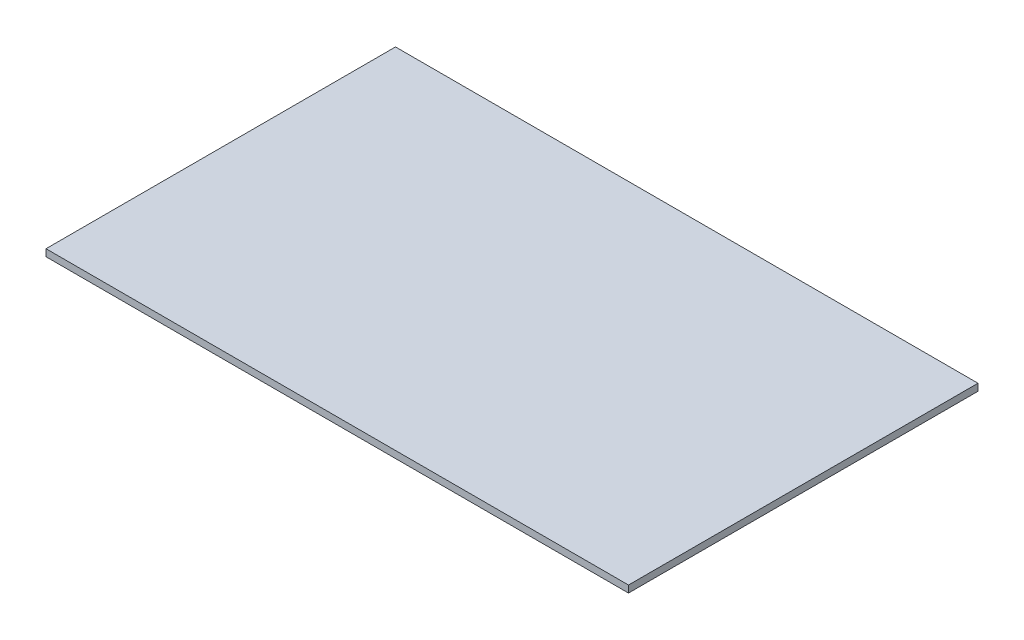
ISO-10303-21;
HEADER;
FILE_DESCRIPTION(('STEP AP214'),'2;1');
FILE_NAME('part.step','',(''),(''),'','','');
FILE_SCHEMA(('AUTOMOTIVE_DESIGN { 1 0 10303 214 1 1 1 1 }'));
ENDSEC;
DATA;
#1=APPLICATION_CONTEXT('core data for automotive mechanical design processes');
#2=APPLICATION_PROTOCOL_DEFINITION('international standard','automotive_design',2000,#1);
#3=PRODUCT_CONTEXT('',#1,'mechanical');
#4=PRODUCT('Part','Part','',(#3));
#5=PRODUCT_RELATED_PRODUCT_CATEGORY('part','',(#4));
#6=PRODUCT_DEFINITION_FORMATION('','',#4);
#7=PRODUCT_DEFINITION_CONTEXT('part definition',#1,'design');
#8=PRODUCT_DEFINITION('design','',#6,#7);
#9=PRODUCT_DEFINITION_SHAPE('','',#8);
#10=(LENGTH_UNIT() NAMED_UNIT(*) SI_UNIT(.MILLI.,.METRE.));
#11=(NAMED_UNIT(*) PLANE_ANGLE_UNIT() SI_UNIT($,.RADIAN.));
#12=(NAMED_UNIT(*) SI_UNIT($,.STERADIAN.) SOLID_ANGLE_UNIT());
#13=UNCERTAINTY_MEASURE_WITH_UNIT(LENGTH_MEASURE(1.E-05),#10,'distance_accuracy_value','');
#14=(GEOMETRIC_REPRESENTATION_CONTEXT(3) GLOBAL_UNCERTAINTY_ASSIGNED_CONTEXT((#13)) GLOBAL_UNIT_ASSIGNED_CONTEXT((#10,
#11,#12)) REPRESENTATION_CONTEXT('',''));
#15=CARTESIAN_POINT('',(0.,0.,0.));
#16=DIRECTION('',(0.,0.,1.));
#17=DIRECTION('',(1.,0.,0.));
#18=AXIS2_PLACEMENT_3D('',#15,#16,#17);
#19=CARTESIAN_POINT('',(762.,18.25625,-457.2));
#20=DIRECTION('',(-1.,0.,0.));
#21=DIRECTION('',(0.,0.,1.));
#22=AXIS2_PLACEMENT_3D('',#19,#20,#21);
#23=PLANE('',#22);
#24=DIRECTION('',(0.,0.,-1.));
#25=VECTOR('',#24,1.);
#26=CARTESIAN_POINT('',(762.,0.,-457.2));
#27=LINE('',#26,#25);
#28=CARTESIAN_POINT('',(762.,0.,457.2));
#29=VERTEX_POINT('',#28);
#30=CARTESIAN_POINT('',(762.,0.,-457.2));
#31=VERTEX_POINT('',#30);
#32=EDGE_CURVE('E95',#29,#31,#27,.T.);
#33=ORIENTED_EDGE('',*,*,#32,.T.);
#34=DIRECTION('',(0.,-1.,0.));
#35=VECTOR('',#34,1.);
#36=CARTESIAN_POINT('',(762.,18.25625,-457.2));
#37=LINE('',#36,#35);
#38=CARTESIAN_POINT('',(762.,18.25625,-457.2));
#39=VERTEX_POINT('',#38);
#40=EDGE_CURVE('E11',#39,#31,#37,.T.);
#41=ORIENTED_EDGE('',*,*,#40,.F.);
#42=DIRECTION('',(0.,0.,-1.));
#43=VECTOR('',#42,1.);
#44=CARTESIAN_POINT('',(762.,18.25625,-457.2));
#45=LINE('',#44,#43);
#46=CARTESIAN_POINT('',(762.,18.25625,457.2));
#47=VERTEX_POINT('',#46);
#48=EDGE_CURVE('E83',#47,#39,#45,.T.);
#49=ORIENTED_EDGE('',*,*,#48,.F.);
#50=DIRECTION('',(0.,-1.,0.));
#51=VECTOR('',#50,1.);
#52=CARTESIAN_POINT('',(762.,18.25625,457.2));
#53=LINE('',#52,#51);
#54=EDGE_CURVE('E91',#47,#29,#53,.T.);
#55=ORIENTED_EDGE('',*,*,#54,.T.);
#56=EDGE_LOOP('',(#33,#41,#49,#55));
#57=FACE_BOUND('',#56,.T.);
#58=ADVANCED_FACE('F32',(#57),#23,.F.);
#59=CARTESIAN_POINT('',(-762.,18.25625,-457.2));
#60=DIRECTION('',(0.,0.,1.));
#61=DIRECTION('',(1.,0.,0.));
#62=AXIS2_PLACEMENT_3D('',#59,#60,#61);
#63=PLANE('',#62);
#64=DIRECTION('',(-1.,0.,0.));
#65=VECTOR('',#64,1.);
#66=CARTESIAN_POINT('',(-762.,0.,-457.2));
#67=LINE('',#66,#65);
#68=CARTESIAN_POINT('',(-762.,0.,-457.2));
#69=VERTEX_POINT('',#68);
#70=EDGE_CURVE('E87',#31,#69,#67,.T.);
#71=ORIENTED_EDGE('',*,*,#70,.T.);
#72=DIRECTION('',(0.,-1.,0.));
#73=VECTOR('',#72,1.);
#74=CARTESIAN_POINT('',(-762.,18.25625,-457.2));
#75=LINE('',#74,#73);
#76=CARTESIAN_POINT('',(-762.,18.25625,-457.2));
#77=VERTEX_POINT('',#76);
#78=EDGE_CURVE('E40',#77,#69,#75,.T.);
#79=ORIENTED_EDGE('',*,*,#78,.F.);
#80=DIRECTION('',(-1.,0.,0.));
#81=VECTOR('',#80,1.);
#82=CARTESIAN_POINT('',(-762.,18.25625,-457.2));
#83=LINE('',#82,#81);
#84=EDGE_CURVE('E78',#39,#77,#83,.T.);
#85=ORIENTED_EDGE('',*,*,#84,.F.);
#86=ORIENTED_EDGE('',*,*,#40,.T.);
#87=EDGE_LOOP('',(#71,#79,#85,#86));
#88=FACE_BOUND('',#87,.T.);
#89=ADVANCED_FACE('F86',(#88),#63,.F.);
#90=CARTESIAN_POINT('',(-762.,18.25625,-457.2));
#91=DIRECTION('',(1.,0.,0.));
#92=DIRECTION('',(0.,0.,-1.));
#93=AXIS2_PLACEMENT_3D('',#90,#91,#92);
#94=PLANE('',#93);
#95=DIRECTION('',(0.,0.,1.));
#96=VECTOR('',#95,1.);
#97=CARTESIAN_POINT('',(-762.,0.,-457.2));
#98=LINE('',#97,#96);
#99=CARTESIAN_POINT('',(-762.,0.,457.2));
#100=VERTEX_POINT('',#99);
#101=EDGE_CURVE('E65',#69,#100,#98,.T.);
#102=ORIENTED_EDGE('',*,*,#101,.T.);
#103=DIRECTION('',(0.,-1.,0.));
#104=VECTOR('',#103,1.);
#105=CARTESIAN_POINT('',(-762.,18.25625,457.2));
#106=LINE('',#105,#104);
#107=CARTESIAN_POINT('',(-762.,18.25625,457.2));
#108=VERTEX_POINT('',#107);
#109=EDGE_CURVE('E88',#108,#100,#106,.T.);
#110=ORIENTED_EDGE('',*,*,#109,.F.);
#111=DIRECTION('',(0.,0.,1.));
#112=VECTOR('',#111,1.);
#113=CARTESIAN_POINT('',(-762.,18.25625,-457.2));
#114=LINE('',#113,#112);
#115=EDGE_CURVE('E81',#77,#108,#114,.T.);
#116=ORIENTED_EDGE('',*,*,#115,.F.);
#117=ORIENTED_EDGE('',*,*,#78,.T.);
#118=EDGE_LOOP('',(#102,#110,#116,#117));
#119=FACE_BOUND('',#118,.T.);
#120=ADVANCED_FACE('F89',(#119),#94,.F.);
#121=CARTESIAN_POINT('',(-762.,18.25625,457.2));
#122=DIRECTION('',(0.,0.,-1.));
#123=DIRECTION('',(-1.,0.,0.));
#124=AXIS2_PLACEMENT_3D('',#121,#122,#123);
#125=PLANE('',#124);
#126=DIRECTION('',(1.,0.,0.));
#127=VECTOR('',#126,1.);
#128=CARTESIAN_POINT('',(-762.,0.,457.2));
#129=LINE('',#128,#127);
#130=EDGE_CURVE('E71',#100,#29,#129,.T.);
#131=ORIENTED_EDGE('',*,*,#130,.T.);
#132=ORIENTED_EDGE('',*,*,#54,.F.);
#133=DIRECTION('',(1.,0.,0.));
#134=VECTOR('',#133,1.);
#135=CARTESIAN_POINT('',(-762.,18.25625,457.2));
#136=LINE('',#135,#134);
#137=EDGE_CURVE('E48',#108,#47,#136,.T.);
#138=ORIENTED_EDGE('',*,*,#137,.F.);
#139=ORIENTED_EDGE('',*,*,#109,.T.);
#140=EDGE_LOOP('',(#131,#132,#138,#139));
#141=FACE_BOUND('',#140,.T.);
#142=ADVANCED_FACE('F102',(#141),#125,.F.);
#143=CARTESIAN_POINT('',(0.,18.25625,0.));
#144=DIRECTION('',(0.,1.,0.));
#145=DIRECTION('',(0.,0.,1.));
#146=AXIS2_PLACEMENT_3D('',#143,#144,#145);
#147=PLANE('',#146);
#148=ORIENTED_EDGE('',*,*,#48,.T.);
#149=ORIENTED_EDGE('',*,*,#84,.T.);
#150=ORIENTED_EDGE('',*,*,#115,.T.);
#151=ORIENTED_EDGE('',*,*,#137,.T.);
#152=EDGE_LOOP('',(#148,#149,#150,#151));
#153=FACE_BOUND('',#152,.T.);
#154=ADVANCED_FACE('F79',(#153),#147,.T.);
#155=CARTESIAN_POINT('',(0.,0.,0.));
#156=DIRECTION('',(0.,1.,0.));
#157=DIRECTION('',(0.,0.,1.));
#158=AXIS2_PLACEMENT_3D('',#155,#156,#157);
#159=PLANE('',#158);
#160=ORIENTED_EDGE('',*,*,#32,.F.);
#161=ORIENTED_EDGE('',*,*,#130,.F.);
#162=ORIENTED_EDGE('',*,*,#101,.F.);
#163=ORIENTED_EDGE('',*,*,#70,.F.);
#164=EDGE_LOOP('',(#160,#161,#162,#163));
#165=FACE_BOUND('',#164,.T.);
#166=ADVANCED_FACE('F105',(#165),#159,.F.);
#167=CLOSED_SHELL('',(#58,#89,#120,#142,#154,#166));
#168=MANIFOLD_SOLID_BREP('B2',#167);
#169=ADVANCED_BREP_SHAPE_REPRESENTATION('',(#18,#168),#14);
#170=SHAPE_DEFINITION_REPRESENTATION(#9,#169);
ENDSEC;
END-ISO-10303-21;
